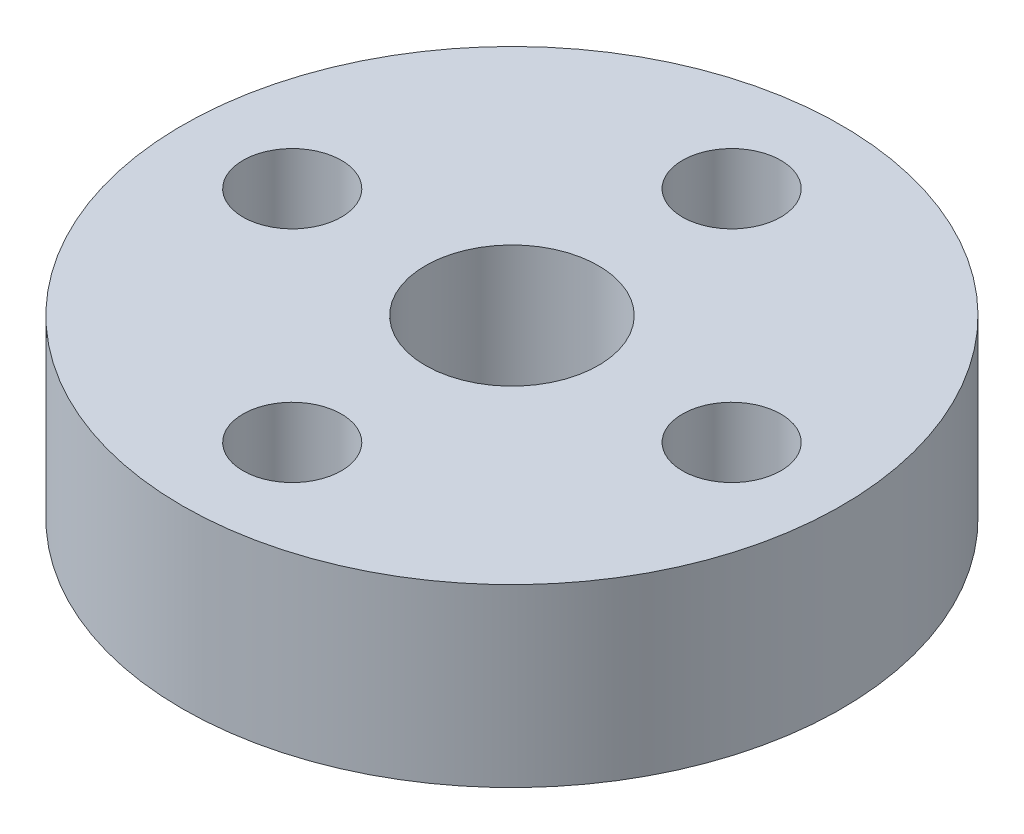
ISO-10303-21;
HEADER;
FILE_DESCRIPTION(('STEP AP214'),'2;1');
FILE_NAME('part.step','',(''),(''),'','','');
FILE_SCHEMA(('AUTOMOTIVE_DESIGN { 1 0 10303 214 1 1 1 1 }'));
ENDSEC;
DATA;
#1=APPLICATION_CONTEXT('core data for automotive mechanical design processes');
#2=APPLICATION_PROTOCOL_DEFINITION('international standard','automotive_design',2000,#1);
#3=PRODUCT_CONTEXT('',#1,'mechanical');
#4=PRODUCT('Part','Part','',(#3));
#5=PRODUCT_RELATED_PRODUCT_CATEGORY('part','',(#4));
#6=PRODUCT_DEFINITION_FORMATION('','',#4);
#7=PRODUCT_DEFINITION_CONTEXT('part definition',#1,'design');
#8=PRODUCT_DEFINITION('design','',#6,#7);
#9=PRODUCT_DEFINITION_SHAPE('','',#8);
#10=(LENGTH_UNIT() NAMED_UNIT(*) SI_UNIT(.MILLI.,.METRE.));
#11=(NAMED_UNIT(*) PLANE_ANGLE_UNIT() SI_UNIT($,.RADIAN.));
#12=(NAMED_UNIT(*) SI_UNIT($,.STERADIAN.) SOLID_ANGLE_UNIT());
#13=UNCERTAINTY_MEASURE_WITH_UNIT(LENGTH_MEASURE(1.E-05),#10,'distance_accuracy_value','');
#14=(GEOMETRIC_REPRESENTATION_CONTEXT(3) GLOBAL_UNCERTAINTY_ASSIGNED_CONTEXT((#13)) GLOBAL_UNIT_ASSIGNED_CONTEXT((#10,
#11,#12)) REPRESENTATION_CONTEXT('',''));
#15=CARTESIAN_POINT('',(0.,0.,0.));
#16=DIRECTION('',(0.,0.,1.));
#17=DIRECTION('',(1.,0.,0.));
#18=AXIS2_PLACEMENT_3D('',#15,#16,#17);
#19=CARTESIAN_POINT('',(0.,5.08,0.));
#20=DIRECTION('',(0.,1.,0.));
#21=DIRECTION('',(0.,0.,1.));
#22=AXIS2_PLACEMENT_3D('',#19,#20,#21);
#23=PLANE('',#22);
#24=CARTESIAN_POINT('',(-6.35,5.08,0.));
#25=DIRECTION('',(0.,1.,0.));
#26=DIRECTION('',(0.,0.,1.));
#27=AXIS2_PLACEMENT_3D('',#24,#25,#26);
#28=CIRCLE('',#27,1.4224);
#29=CARTESIAN_POINT('',(-6.35,5.08,1.4224));
#30=VERTEX_POINT('',#29);
#31=EDGE_CURVE('E72',#30,#30,#28,.T.);
#32=ORIENTED_EDGE('',*,*,#31,.F.);
#33=EDGE_LOOP('',(#32));
#34=FACE_BOUND('',#33,.T.);
#35=CARTESIAN_POINT('',(0.,5.08,-6.35));
#36=DIRECTION('',(0.,1.,0.));
#37=DIRECTION('',(0.,0.,1.));
#38=AXIS2_PLACEMENT_3D('',#35,#36,#37);
#39=CIRCLE('',#38,1.4224);
#40=CARTESIAN_POINT('',(0.,5.08,-4.9276));
#41=VERTEX_POINT('',#40);
#42=EDGE_CURVE('E66',#41,#41,#39,.T.);
#43=ORIENTED_EDGE('',*,*,#42,.F.);
#44=EDGE_LOOP('',(#43));
#45=FACE_BOUND('',#44,.T.);
#46=CARTESIAN_POINT('',(6.35,5.08,0.));
#47=DIRECTION('',(0.,1.,0.));
#48=DIRECTION('',(0.,0.,1.));
#49=AXIS2_PLACEMENT_3D('',#46,#47,#48);
#50=CIRCLE('',#49,1.4224);
#51=CARTESIAN_POINT('',(6.35,5.08,1.4224));
#52=VERTEX_POINT('',#51);
#53=EDGE_CURVE('E60',#52,#52,#50,.T.);
#54=ORIENTED_EDGE('',*,*,#53,.F.);
#55=EDGE_LOOP('',(#54));
#56=FACE_BOUND('',#55,.T.);
#57=CARTESIAN_POINT('',(0.,5.08,6.35));
#58=DIRECTION('',(0.,1.,0.));
#59=DIRECTION('',(0.,0.,1.));
#60=AXIS2_PLACEMENT_3D('',#57,#58,#59);
#61=CIRCLE('',#60,1.4224);
#62=CARTESIAN_POINT('',(0.,5.08,7.7724));
#63=VERTEX_POINT('',#62);
#64=EDGE_CURVE('E54',#63,#63,#61,.T.);
#65=ORIENTED_EDGE('',*,*,#64,.F.);
#66=EDGE_LOOP('',(#65));
#67=FACE_BOUND('',#66,.T.);
#68=CARTESIAN_POINT('',(0.,5.08,0.));
#69=DIRECTION('',(0.,1.,0.));
#70=DIRECTION('',(0.,0.,1.));
#71=AXIS2_PLACEMENT_3D('',#68,#69,#70);
#72=CIRCLE('',#71,9.525);
#73=CARTESIAN_POINT('',(0.,5.08,9.525));
#74=VERTEX_POINT('',#73);
#75=EDGE_CURVE('E10',#74,#74,#72,.T.);
#76=ORIENTED_EDGE('',*,*,#75,.T.);
#77=EDGE_LOOP('',(#76));
#78=FACE_BOUND('',#77,.T.);
#79=CARTESIAN_POINT('',(0.,5.08,0.));
#80=DIRECTION('',(0.,1.,0.));
#81=DIRECTION('',(0.,0.,1.));
#82=AXIS2_PLACEMENT_3D('',#79,#80,#81);
#83=CIRCLE('',#82,2.5);
#84=CARTESIAN_POINT('',(0.,5.08,2.5));
#85=VERTEX_POINT('',#84);
#86=EDGE_CURVE('E44',#85,#85,#83,.T.);
#87=ORIENTED_EDGE('',*,*,#86,.F.);
#88=EDGE_LOOP('',(#87));
#89=FACE_BOUND('',#88,.T.);
#90=ADVANCED_FACE('F33',(#34,#45,#56,#67,#78,#89),#23,.T.);
#91=CARTESIAN_POINT('',(0.,0.,0.));
#92=DIRECTION('',(0.,1.,0.));
#93=DIRECTION('',(0.,0.,1.));
#94=AXIS2_PLACEMENT_3D('',#91,#92,#93);
#95=PLANE('',#94);
#96=CARTESIAN_POINT('',(-6.35,0.,0.));
#97=DIRECTION('',(0.,1.,0.));
#98=DIRECTION('',(0.,0.,1.));
#99=AXIS2_PLACEMENT_3D('',#96,#97,#98);
#100=CIRCLE('',#99,1.4224);
#101=CARTESIAN_POINT('',(-6.35,0.,1.4224));
#102=VERTEX_POINT('',#101);
#103=EDGE_CURVE('E69',#102,#102,#100,.T.);
#104=ORIENTED_EDGE('',*,*,#103,.T.);
#105=EDGE_LOOP('',(#104));
#106=FACE_BOUND('',#105,.T.);
#107=CARTESIAN_POINT('',(0.,0.,-6.35));
#108=DIRECTION('',(0.,1.,0.));
#109=DIRECTION('',(0.,0.,1.));
#110=AXIS2_PLACEMENT_3D('',#107,#108,#109);
#111=CIRCLE('',#110,1.4224);
#112=CARTESIAN_POINT('',(0.,0.,-4.9276));
#113=VERTEX_POINT('',#112);
#114=EDGE_CURVE('E63',#113,#113,#111,.T.);
#115=ORIENTED_EDGE('',*,*,#114,.T.);
#116=EDGE_LOOP('',(#115));
#117=FACE_BOUND('',#116,.T.);
#118=CARTESIAN_POINT('',(6.35,0.,0.));
#119=DIRECTION('',(0.,1.,0.));
#120=DIRECTION('',(0.,0.,1.));
#121=AXIS2_PLACEMENT_3D('',#118,#119,#120);
#122=CIRCLE('',#121,1.4224);
#123=CARTESIAN_POINT('',(6.35,0.,1.4224));
#124=VERTEX_POINT('',#123);
#125=EDGE_CURVE('E57',#124,#124,#122,.T.);
#126=ORIENTED_EDGE('',*,*,#125,.T.);
#127=EDGE_LOOP('',(#126));
#128=FACE_BOUND('',#127,.T.);
#129=CARTESIAN_POINT('',(0.,0.,6.35));
#130=DIRECTION('',(0.,1.,0.));
#131=DIRECTION('',(0.,0.,1.));
#132=AXIS2_PLACEMENT_3D('',#129,#130,#131);
#133=CIRCLE('',#132,1.4224);
#134=CARTESIAN_POINT('',(0.,0.,7.7724));
#135=VERTEX_POINT('',#134);
#136=EDGE_CURVE('E49',#135,#135,#133,.T.);
#137=ORIENTED_EDGE('',*,*,#136,.T.);
#138=EDGE_LOOP('',(#137));
#139=FACE_BOUND('',#138,.T.);
#140=CARTESIAN_POINT('',(0.,0.,0.));
#141=DIRECTION('',(0.,1.,0.));
#142=DIRECTION('',(0.,0.,1.));
#143=AXIS2_PLACEMENT_3D('',#140,#141,#142);
#144=CIRCLE('',#143,9.525);
#145=CARTESIAN_POINT('',(0.,0.,9.525));
#146=VERTEX_POINT('',#145);
#147=EDGE_CURVE('E37',#146,#146,#144,.T.);
#148=ORIENTED_EDGE('',*,*,#147,.F.);
#149=EDGE_LOOP('',(#148));
#150=FACE_BOUND('',#149,.T.);
#151=CARTESIAN_POINT('',(0.,0.,0.));
#152=DIRECTION('',(0.,1.,0.));
#153=DIRECTION('',(0.,0.,1.));
#154=AXIS2_PLACEMENT_3D('',#151,#152,#153);
#155=CIRCLE('',#154,2.5);
#156=CARTESIAN_POINT('',(0.,0.,2.5));
#157=VERTEX_POINT('',#156);
#158=EDGE_CURVE('E46',#157,#157,#155,.T.);
#159=ORIENTED_EDGE('',*,*,#158,.T.);
#160=EDGE_LOOP('',(#159));
#161=FACE_BOUND('',#160,.T.);
#162=ADVANCED_FACE('F80',(#106,#117,#128,#139,#150,#161),#95,.F.);
#163=CARTESIAN_POINT('',(0.,5.08,0.));
#164=DIRECTION('',(0.,-1.,0.));
#165=DIRECTION('',(0.,0.,-1.));
#166=AXIS2_PLACEMENT_3D('',#163,#164,#165);
#167=CYLINDRICAL_SURFACE('',#166,9.525);
#168=ORIENTED_EDGE('',*,*,#75,.F.);
#169=EDGE_LOOP('',(#168));
#170=FACE_BOUND('',#169,.T.);
#171=ORIENTED_EDGE('',*,*,#147,.T.);
#172=EDGE_LOOP('',(#171));
#173=FACE_BOUND('',#172,.T.);
#174=ADVANCED_FACE('F35',(#170,#173),#167,.T.);
#175=CARTESIAN_POINT('',(0.,5.08,0.));
#176=DIRECTION('',(0.,-1.,0.));
#177=DIRECTION('',(0.,0.,-1.));
#178=AXIS2_PLACEMENT_3D('',#175,#176,#177);
#179=CYLINDRICAL_SURFACE('',#178,2.5);
#180=ORIENTED_EDGE('',*,*,#86,.T.);
#181=EDGE_LOOP('',(#180));
#182=FACE_BOUND('',#181,.T.);
#183=ORIENTED_EDGE('',*,*,#158,.F.);
#184=EDGE_LOOP('',(#183));
#185=FACE_BOUND('',#184,.T.);
#186=ADVANCED_FACE('F90',(#182,#185),#179,.F.);
#187=CARTESIAN_POINT('',(0.,5.08,6.35));
#188=DIRECTION('',(0.,1.,0.));
#189=DIRECTION('',(0.,0.,1.));
#190=AXIS2_PLACEMENT_3D('',#187,#188,#189);
#191=CYLINDRICAL_SURFACE('',#190,1.4224);
#192=ORIENTED_EDGE('',*,*,#136,.F.);
#193=EDGE_LOOP('',(#192));
#194=FACE_BOUND('',#193,.T.);
#195=ORIENTED_EDGE('',*,*,#64,.T.);
#196=EDGE_LOOP('',(#195));
#197=FACE_BOUND('',#196,.T.);
#198=ADVANCED_FACE('F93',(#194,#197),#191,.F.);
#199=CARTESIAN_POINT('',(6.35,5.08,0.));
#200=DIRECTION('',(0.,1.,0.));
#201=DIRECTION('',(0.,0.,1.));
#202=AXIS2_PLACEMENT_3D('',#199,#200,#201);
#203=CYLINDRICAL_SURFACE('',#202,1.4224);
#204=ORIENTED_EDGE('',*,*,#125,.F.);
#205=EDGE_LOOP('',(#204));
#206=FACE_BOUND('',#205,.T.);
#207=ORIENTED_EDGE('',*,*,#53,.T.);
#208=EDGE_LOOP('',(#207));
#209=FACE_BOUND('',#208,.T.);
#210=ADVANCED_FACE('F107',(#206,#209),#203,.F.);
#211=CARTESIAN_POINT('',(0.,5.08,-6.35));
#212=DIRECTION('',(0.,1.,0.));
#213=DIRECTION('',(0.,0.,1.));
#214=AXIS2_PLACEMENT_3D('',#211,#212,#213);
#215=CYLINDRICAL_SURFACE('',#214,1.4224);
#216=ORIENTED_EDGE('',*,*,#114,.F.);
#217=EDGE_LOOP('',(#216));
#218=FACE_BOUND('',#217,.T.);
#219=ORIENTED_EDGE('',*,*,#42,.T.);
#220=EDGE_LOOP('',(#219));
#221=FACE_BOUND('',#220,.T.);
#222=ADVANCED_FACE('F111',(#218,#221),#215,.F.);
#223=CARTESIAN_POINT('',(-6.35,5.08,0.));
#224=DIRECTION('',(0.,1.,0.));
#225=DIRECTION('',(0.,0.,1.));
#226=AXIS2_PLACEMENT_3D('',#223,#224,#225);
#227=CYLINDRICAL_SURFACE('',#226,1.4224);
#228=ORIENTED_EDGE('',*,*,#103,.F.);
#229=EDGE_LOOP('',(#228));
#230=FACE_BOUND('',#229,.T.);
#231=ORIENTED_EDGE('',*,*,#31,.T.);
#232=EDGE_LOOP('',(#231));
#233=FACE_BOUND('',#232,.T.);
#234=ADVANCED_FACE('F76',(#230,#233),#227,.F.);
#235=CLOSED_SHELL('',(#90,#162,#174,#186,#198,#210,#222,#234));
#236=MANIFOLD_SOLID_BREP('B2',#235);
#237=ADVANCED_BREP_SHAPE_REPRESENTATION('',(#18,#236),#14);
#238=SHAPE_DEFINITION_REPRESENTATION(#9,#237);
ENDSEC;
END-ISO-10303-21;
